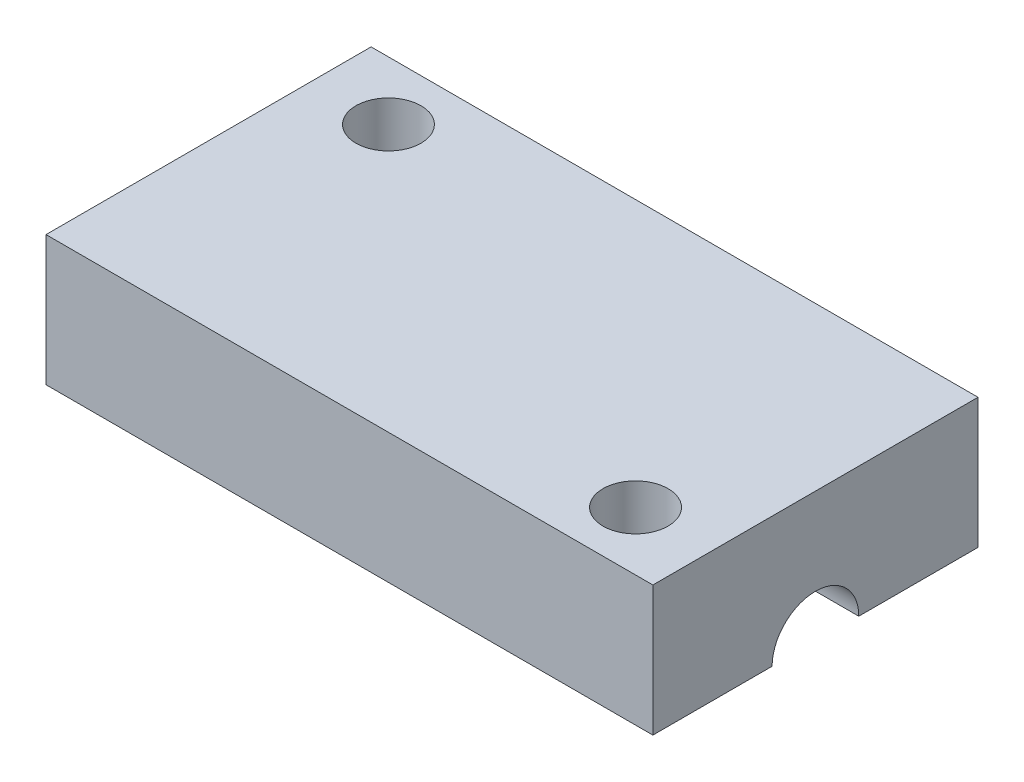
ISO-10303-21;
HEADER;
FILE_DESCRIPTION(('STEP AP214'),'2;1');
FILE_NAME('part.step','',(''),(''),'','','');
FILE_SCHEMA(('AUTOMOTIVE_DESIGN { 1 0 10303 214 1 1 1 1 }'));
ENDSEC;
DATA;
#1=APPLICATION_CONTEXT('core data for automotive mechanical design processes');
#2=APPLICATION_PROTOCOL_DEFINITION('international standard','automotive_design',2000,#1);
#3=PRODUCT_CONTEXT('',#1,'mechanical');
#4=PRODUCT('Part','Part','',(#3));
#5=PRODUCT_RELATED_PRODUCT_CATEGORY('part','',(#4));
#6=PRODUCT_DEFINITION_FORMATION('','',#4);
#7=PRODUCT_DEFINITION_CONTEXT('part definition',#1,'design');
#8=PRODUCT_DEFINITION('design','',#6,#7);
#9=PRODUCT_DEFINITION_SHAPE('','',#8);
#10=(LENGTH_UNIT() NAMED_UNIT(*) SI_UNIT(.MILLI.,.METRE.));
#11=(NAMED_UNIT(*) PLANE_ANGLE_UNIT() SI_UNIT($,.RADIAN.));
#12=(NAMED_UNIT(*) SI_UNIT($,.STERADIAN.) SOLID_ANGLE_UNIT());
#13=UNCERTAINTY_MEASURE_WITH_UNIT(LENGTH_MEASURE(1.E-05),#10,'distance_accuracy_value','');
#14=(GEOMETRIC_REPRESENTATION_CONTEXT(3) GLOBAL_UNCERTAINTY_ASSIGNED_CONTEXT((#13)) GLOBAL_UNIT_ASSIGNED_CONTEXT((#10,
#11,#12)) REPRESENTATION_CONTEXT('',''));
#15=CARTESIAN_POINT('',(0.,0.,0.));
#16=DIRECTION('',(0.,0.,1.));
#17=DIRECTION('',(1.,0.,0.));
#18=AXIS2_PLACEMENT_3D('',#15,#16,#17);
#19=CARTESIAN_POINT('',(14.,0.,7.5));
#20=DIRECTION('',(0.,0.,-1.));
#21=DIRECTION('',(-1.,0.,0.));
#22=AXIS2_PLACEMENT_3D('',#19,#20,#21);
#23=PLANE('',#22);
#24=DIRECTION('',(0.,-1.,0.));
#25=VECTOR('',#24,1.);
#26=CARTESIAN_POINT('',(-14.,0.,7.5));
#27=LINE('',#26,#25);
#28=CARTESIAN_POINT('',(-14.,6.,7.5));
#29=VERTEX_POINT('',#28);
#30=CARTESIAN_POINT('',(-14.,0.,7.5));
#31=VERTEX_POINT('',#30);
#32=EDGE_CURVE('E117',#29,#31,#27,.T.);
#33=ORIENTED_EDGE('',*,*,#32,.T.);
#34=DIRECTION('',(-1.,0.,0.));
#35=VECTOR('',#34,1.);
#36=CARTESIAN_POINT('',(14.,0.,7.5));
#37=LINE('',#36,#35);
#38=CARTESIAN_POINT('',(14.,0.,7.5));
#39=VERTEX_POINT('',#38);
#40=EDGE_CURVE('E11',#39,#31,#37,.T.);
#41=ORIENTED_EDGE('',*,*,#40,.F.);
#42=DIRECTION('',(0.,-1.,0.));
#43=VECTOR('',#42,1.);
#44=CARTESIAN_POINT('',(14.,0.,7.5));
#45=LINE('',#44,#43);
#46=CARTESIAN_POINT('',(14.,6.,7.5));
#47=VERTEX_POINT('',#46);
#48=EDGE_CURVE('E128',#47,#39,#45,.T.);
#49=ORIENTED_EDGE('',*,*,#48,.F.);
#50=DIRECTION('',(-1.,0.,0.));
#51=VECTOR('',#50,1.);
#52=CARTESIAN_POINT('',(14.,6.,7.5));
#53=LINE('',#52,#51);
#54=EDGE_CURVE('E113',#47,#29,#53,.T.);
#55=ORIENTED_EDGE('',*,*,#54,.T.);
#56=EDGE_LOOP('',(#33,#41,#49,#55));
#57=FACE_BOUND('',#56,.T.);
#58=ADVANCED_FACE('F33',(#57),#23,.F.);
#59=CARTESIAN_POINT('',(14.,0.,7.5));
#60=DIRECTION('',(0.,1.,0.));
#61=DIRECTION('',(0.,0.,1.));
#62=AXIS2_PLACEMENT_3D('',#59,#60,#61);
#63=PLANE('',#62);
#64=CARTESIAN_POINT('',(10.5,0.,4.79999999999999));
#65=DIRECTION('',(0.,1.,0.));
#66=DIRECTION('',(0.,0.,1.));
#67=AXIS2_PLACEMENT_3D('',#64,#65,#66);
#68=CIRCLE('',#67,1.5);
#69=CARTESIAN_POINT('',(10.5,0.,6.29999999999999));
#70=VERTEX_POINT('',#69);
#71=EDGE_CURVE('E176',#70,#70,#68,.T.);
#72=ORIENTED_EDGE('',*,*,#71,.T.);
#73=EDGE_LOOP('',(#72));
#74=FACE_BOUND('',#73,.T.);
#75=DIRECTION('',(0.,0.,-1.));
#76=VECTOR('',#75,1.);
#77=CARTESIAN_POINT('',(-14.,0.,7.5));
#78=LINE('',#77,#76);
#79=CARTESIAN_POINT('',(-14.,0.,2.));
#80=VERTEX_POINT('',#79);
#81=EDGE_CURVE('E120',#31,#80,#78,.T.);
#82=ORIENTED_EDGE('',*,*,#81,.T.);
#83=DIRECTION('',(-1.,0.,0.));
#84=VECTOR('',#83,1.);
#85=CARTESIAN_POINT('',(14.,0.,2.));
#86=LINE('',#85,#84);
#87=CARTESIAN_POINT('',(14.,0.,2.));
#88=VERTEX_POINT('',#87);
#89=EDGE_CURVE('E41',#88,#80,#86,.T.);
#90=ORIENTED_EDGE('',*,*,#89,.F.);
#91=DIRECTION('',(0.,0.,-1.));
#92=VECTOR('',#91,1.);
#93=CARTESIAN_POINT('',(14.,0.,7.5));
#94=LINE('',#93,#92);
#95=EDGE_CURVE('E86',#39,#88,#94,.T.);
#96=ORIENTED_EDGE('',*,*,#95,.F.);
#97=ORIENTED_EDGE('',*,*,#40,.T.);
#98=EDGE_LOOP('',(#82,#90,#96,#97));
#99=FACE_BOUND('',#98,.T.);
#100=ADVANCED_FACE('F155',(#74,#99),#63,.F.);
#101=CARTESIAN_POINT('',(14.,0.,0.));
#102=DIRECTION('',(-1.,0.,0.));
#103=DIRECTION('',(0.,0.,1.));
#104=AXIS2_PLACEMENT_3D('',#101,#102,#103);
#105=CYLINDRICAL_SURFACE('',#104,2.);
#106=CARTESIAN_POINT('',(-14.,0.,0.));
#107=DIRECTION('',(-1.,0.,0.));
#108=DIRECTION('',(0.,0.,-1.));
#109=AXIS2_PLACEMENT_3D('',#106,#107,#108);
#110=CIRCLE('',#109,2.);
#111=CARTESIAN_POINT('',(-14.,0.,-2.));
#112=VERTEX_POINT('',#111);
#113=EDGE_CURVE('E123',#80,#112,#110,.T.);
#114=ORIENTED_EDGE('',*,*,#113,.T.);
#115=DIRECTION('',(-1.,0.,0.));
#116=VECTOR('',#115,1.);
#117=CARTESIAN_POINT('',(14.,0.,-2.));
#118=LINE('',#117,#116);
#119=CARTESIAN_POINT('',(14.,0.,-2.));
#120=VERTEX_POINT('',#119);
#121=EDGE_CURVE('E108',#120,#112,#118,.T.);
#122=ORIENTED_EDGE('',*,*,#121,.F.);
#123=CARTESIAN_POINT('',(14.,0.,0.));
#124=DIRECTION('',(-1.,0.,0.));
#125=DIRECTION('',(0.,0.,-1.));
#126=AXIS2_PLACEMENT_3D('',#123,#124,#125);
#127=CIRCLE('',#126,2.);
#128=EDGE_CURVE('E99',#88,#120,#127,.T.);
#129=ORIENTED_EDGE('',*,*,#128,.F.);
#130=ORIENTED_EDGE('',*,*,#89,.T.);
#131=EDGE_LOOP('',(#114,#122,#129,#130));
#132=FACE_BOUND('',#131,.T.);
#133=ADVANCED_FACE('F134',(#132),#105,.F.);
#134=CARTESIAN_POINT('',(14.,0.,-2.));
#135=DIRECTION('',(0.,1.,0.));
#136=DIRECTION('',(0.,0.,1.));
#137=AXIS2_PLACEMENT_3D('',#134,#135,#136);
#138=PLANE('',#137);
#139=CARTESIAN_POINT('',(-10.5,0.,-4.8));
#140=DIRECTION('',(0.,1.,0.));
#141=DIRECTION('',(0.,0.,1.));
#142=AXIS2_PLACEMENT_3D('',#139,#140,#141);
#143=CIRCLE('',#142,1.5);
#144=CARTESIAN_POINT('',(-10.5,0.,-3.3));
#145=VERTEX_POINT('',#144);
#146=EDGE_CURVE('E121',#145,#145,#143,.T.);
#147=ORIENTED_EDGE('',*,*,#146,.T.);
#148=EDGE_LOOP('',(#147));
#149=FACE_BOUND('',#148,.T.);
#150=DIRECTION('',(0.,0.,-1.));
#151=VECTOR('',#150,1.);
#152=CARTESIAN_POINT('',(-14.,0.,-2.));
#153=LINE('',#152,#151);
#154=CARTESIAN_POINT('',(-14.,0.,-7.5));
#155=VERTEX_POINT('',#154);
#156=EDGE_CURVE('E107',#112,#155,#153,.T.);
#157=ORIENTED_EDGE('',*,*,#156,.T.);
#158=DIRECTION('',(-1.,0.,0.));
#159=VECTOR('',#158,1.);
#160=CARTESIAN_POINT('',(14.,0.,-7.5));
#161=LINE('',#160,#159);
#162=CARTESIAN_POINT('',(14.,0.,-7.5));
#163=VERTEX_POINT('',#162);
#164=EDGE_CURVE('E104',#163,#155,#161,.T.);
#165=ORIENTED_EDGE('',*,*,#164,.F.);
#166=DIRECTION('',(0.,0.,-1.));
#167=VECTOR('',#166,1.);
#168=CARTESIAN_POINT('',(14.,0.,-2.));
#169=LINE('',#168,#167);
#170=EDGE_CURVE('E93',#120,#163,#169,.T.);
#171=ORIENTED_EDGE('',*,*,#170,.F.);
#172=ORIENTED_EDGE('',*,*,#121,.T.);
#173=EDGE_LOOP('',(#157,#165,#171,#172));
#174=FACE_BOUND('',#173,.T.);
#175=ADVANCED_FACE('F105',(#149,#174),#138,.F.);
#176=CARTESIAN_POINT('',(14.,0.,-7.5));
#177=DIRECTION('',(0.,0.,1.));
#178=DIRECTION('',(1.,0.,0.));
#179=AXIS2_PLACEMENT_3D('',#176,#177,#178);
#180=PLANE('',#179);
#181=DIRECTION('',(0.,1.,0.));
#182=VECTOR('',#181,1.);
#183=CARTESIAN_POINT('',(-14.,0.,-7.5));
#184=LINE('',#183,#182);
#185=CARTESIAN_POINT('',(-14.,6.,-7.5));
#186=VERTEX_POINT('',#185);
#187=EDGE_CURVE('E72',#155,#186,#184,.T.);
#188=ORIENTED_EDGE('',*,*,#187,.T.);
#189=DIRECTION('',(-1.,0.,0.));
#190=VECTOR('',#189,1.);
#191=CARTESIAN_POINT('',(14.,6.,-7.5));
#192=LINE('',#191,#190);
#193=CARTESIAN_POINT('',(14.,6.,-7.5));
#194=VERTEX_POINT('',#193);
#195=EDGE_CURVE('E109',#194,#186,#192,.T.);
#196=ORIENTED_EDGE('',*,*,#195,.F.);
#197=DIRECTION('',(0.,1.,0.));
#198=VECTOR('',#197,1.);
#199=CARTESIAN_POINT('',(14.,0.,-7.5));
#200=LINE('',#199,#198);
#201=EDGE_CURVE('E97',#163,#194,#200,.T.);
#202=ORIENTED_EDGE('',*,*,#201,.F.);
#203=ORIENTED_EDGE('',*,*,#164,.T.);
#204=EDGE_LOOP('',(#188,#196,#202,#203));
#205=FACE_BOUND('',#204,.T.);
#206=ADVANCED_FACE('F111',(#205),#180,.F.);
#207=CARTESIAN_POINT('',(14.,6.,7.5));
#208=DIRECTION('',(0.,-1.,0.));
#209=DIRECTION('',(0.,0.,-1.));
#210=AXIS2_PLACEMENT_3D('',#207,#208,#209);
#211=PLANE('',#210);
#212=CARTESIAN_POINT('',(-10.5,6.,-4.8));
#213=DIRECTION('',(0.,1.,0.));
#214=DIRECTION('',(0.,0.,1.));
#215=AXIS2_PLACEMENT_3D('',#212,#213,#214);
#216=CIRCLE('',#215,1.5);
#217=CARTESIAN_POINT('',(-10.5,6.,-3.3));
#218=VERTEX_POINT('',#217);
#219=EDGE_CURVE('E173',#218,#218,#216,.T.);
#220=ORIENTED_EDGE('',*,*,#219,.F.);
#221=EDGE_LOOP('',(#220));
#222=FACE_BOUND('',#221,.T.);
#223=CARTESIAN_POINT('',(10.5,6.,4.79999999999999));
#224=DIRECTION('',(0.,1.,0.));
#225=DIRECTION('',(0.,0.,1.));
#226=AXIS2_PLACEMENT_3D('',#223,#224,#225);
#227=CIRCLE('',#226,1.5);
#228=CARTESIAN_POINT('',(10.5,6.,6.29999999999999));
#229=VERTEX_POINT('',#228);
#230=EDGE_CURVE('E180',#229,#229,#227,.T.);
#231=ORIENTED_EDGE('',*,*,#230,.F.);
#232=EDGE_LOOP('',(#231));
#233=FACE_BOUND('',#232,.T.);
#234=DIRECTION('',(0.,0.,1.));
#235=VECTOR('',#234,1.);
#236=CARTESIAN_POINT('',(-14.,6.,7.5));
#237=LINE('',#236,#235);
#238=EDGE_CURVE('E78',#186,#29,#237,.T.);
#239=ORIENTED_EDGE('',*,*,#238,.T.);
#240=ORIENTED_EDGE('',*,*,#54,.F.);
#241=DIRECTION('',(0.,0.,1.));
#242=VECTOR('',#241,1.);
#243=CARTESIAN_POINT('',(14.,6.,7.5));
#244=LINE('',#243,#242);
#245=EDGE_CURVE('E49',#194,#47,#244,.T.);
#246=ORIENTED_EDGE('',*,*,#245,.F.);
#247=ORIENTED_EDGE('',*,*,#195,.T.);
#248=EDGE_LOOP('',(#239,#240,#246,#247));
#249=FACE_BOUND('',#248,.T.);
#250=ADVANCED_FACE('F141',(#222,#233,#249),#211,.F.);
#251=CARTESIAN_POINT('',(14.,0.,0.));
#252=DIRECTION('',(1.,0.,0.));
#253=DIRECTION('',(0.,0.,-1.));
#254=AXIS2_PLACEMENT_3D('',#251,#252,#253);
#255=PLANE('',#254);
#256=ORIENTED_EDGE('',*,*,#48,.T.);
#257=ORIENTED_EDGE('',*,*,#95,.T.);
#258=ORIENTED_EDGE('',*,*,#128,.T.);
#259=ORIENTED_EDGE('',*,*,#170,.T.);
#260=ORIENTED_EDGE('',*,*,#201,.T.);
#261=ORIENTED_EDGE('',*,*,#245,.T.);
#262=EDGE_LOOP('',(#256,#257,#258,#259,#260,#261));
#263=FACE_BOUND('',#262,.T.);
#264=ADVANCED_FACE('F95',(#263),#255,.T.);
#265=CARTESIAN_POINT('',(-14.,0.,0.));
#266=DIRECTION('',(1.,0.,0.));
#267=DIRECTION('',(0.,0.,-1.));
#268=AXIS2_PLACEMENT_3D('',#265,#266,#267);
#269=PLANE('',#268);
#270=ORIENTED_EDGE('',*,*,#32,.F.);
#271=ORIENTED_EDGE('',*,*,#238,.F.);
#272=ORIENTED_EDGE('',*,*,#187,.F.);
#273=ORIENTED_EDGE('',*,*,#156,.F.);
#274=ORIENTED_EDGE('',*,*,#113,.F.);
#275=ORIENTED_EDGE('',*,*,#81,.F.);
#276=EDGE_LOOP('',(#270,#271,#272,#273,#274,#275));
#277=FACE_BOUND('',#276,.T.);
#278=ADVANCED_FACE('F137',(#277),#269,.F.);
#279=CARTESIAN_POINT('',(10.5,0.,4.79999999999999));
#280=DIRECTION('',(0.,1.,0.));
#281=DIRECTION('',(0.,0.,1.));
#282=AXIS2_PLACEMENT_3D('',#279,#280,#281);
#283=CYLINDRICAL_SURFACE('',#282,1.5);
#284=ORIENTED_EDGE('',*,*,#71,.F.);
#285=EDGE_LOOP('',(#284));
#286=FACE_BOUND('',#285,.T.);
#287=ORIENTED_EDGE('',*,*,#230,.T.);
#288=EDGE_LOOP('',(#287));
#289=FACE_BOUND('',#288,.T.);
#290=ADVANCED_FACE('F186',(#286,#289),#283,.F.);
#291=CARTESIAN_POINT('',(-10.5,0.,-4.8));
#292=DIRECTION('',(0.,1.,0.));
#293=DIRECTION('',(0.,0.,1.));
#294=AXIS2_PLACEMENT_3D('',#291,#292,#293);
#295=CYLINDRICAL_SURFACE('',#294,1.5);
#296=ORIENTED_EDGE('',*,*,#146,.F.);
#297=EDGE_LOOP('',(#296));
#298=FACE_BOUND('',#297,.T.);
#299=ORIENTED_EDGE('',*,*,#219,.T.);
#300=EDGE_LOOP('',(#299));
#301=FACE_BOUND('',#300,.T.);
#302=ADVANCED_FACE('F188',(#298,#301),#295,.F.);
#303=CLOSED_SHELL('',(#58,#100,#133,#175,#206,#250,#264,#278,#290,#302));
#304=MANIFOLD_SOLID_BREP('B2',#303);
#305=ADVANCED_BREP_SHAPE_REPRESENTATION('',(#18,#304),#14);
#306=SHAPE_DEFINITION_REPRESENTATION(#9,#305);
ENDSEC;
END-ISO-10303-21;
